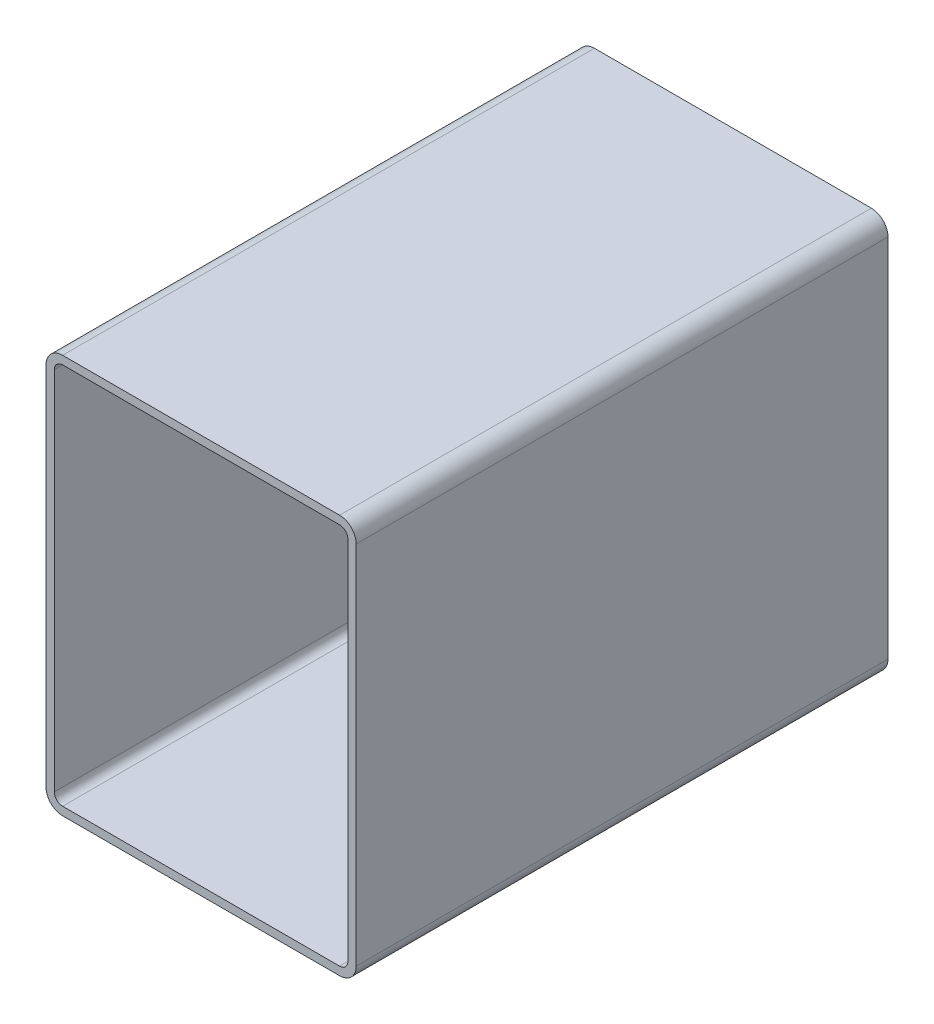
ISO-10303-21;
HEADER;
FILE_DESCRIPTION(('STEP AP214'),'2;1');
FILE_NAME('part.step','',(''),(''),'','','');
FILE_SCHEMA(('AUTOMOTIVE_DESIGN { 1 0 10303 214 1 1 1 1 }'));
ENDSEC;
DATA;
#1=APPLICATION_CONTEXT('core data for automotive mechanical design processes');
#2=APPLICATION_PROTOCOL_DEFINITION('international standard','automotive_design',2000,#1);
#3=PRODUCT_CONTEXT('',#1,'mechanical');
#4=PRODUCT('Part','Part','',(#3));
#5=PRODUCT_RELATED_PRODUCT_CATEGORY('part','',(#4));
#6=PRODUCT_DEFINITION_FORMATION('','',#4);
#7=PRODUCT_DEFINITION_CONTEXT('part definition',#1,'design');
#8=PRODUCT_DEFINITION('design','',#6,#7);
#9=PRODUCT_DEFINITION_SHAPE('','',#8);
#10=(LENGTH_UNIT() NAMED_UNIT(*) SI_UNIT(.MILLI.,.METRE.));
#11=(NAMED_UNIT(*) PLANE_ANGLE_UNIT() SI_UNIT($,.RADIAN.));
#12=(NAMED_UNIT(*) SI_UNIT($,.STERADIAN.) SOLID_ANGLE_UNIT());
#13=UNCERTAINTY_MEASURE_WITH_UNIT(LENGTH_MEASURE(1.E-05),#10,'distance_accuracy_value','');
#14=(GEOMETRIC_REPRESENTATION_CONTEXT(3) GLOBAL_UNCERTAINTY_ASSIGNED_CONTEXT((#13)) GLOBAL_UNIT_ASSIGNED_CONTEXT((#10,
#11,#12)) REPRESENTATION_CONTEXT('',''));
#15=CARTESIAN_POINT('',(0.,0.,0.));
#16=DIRECTION('',(0.,0.,1.));
#17=DIRECTION('',(1.,0.,0.));
#18=AXIS2_PLACEMENT_3D('',#15,#16,#17);
#19=CARTESIAN_POINT('',(170.479878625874,11.4682223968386,304.8));
#20=DIRECTION('',(0.,0.,1.));
#21=DIRECTION('',(1.,0.,0.));
#22=AXIS2_PLACEMENT_3D('',#19,#20,#21);
#23=PLANE('',#22);
#24=CARTESIAN_POINT('',(170.479878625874,11.4682223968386,304.8));
#25=DIRECTION('',(0.,0.,1.));
#26=DIRECTION('',(1.,0.,0.));
#27=AXIS2_PLACEMENT_3D('',#24,#25,#26);
#28=CIRCLE('',#27,9.52500000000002);
#29=CARTESIAN_POINT('',(170.479878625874,1.94322239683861,304.8));
#30=VERTEX_POINT('',#29);
#31=CARTESIAN_POINT('',(180.004878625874,11.4682223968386,304.8));
#32=VERTEX_POINT('',#31);
#33=EDGE_CURVE('E211',#30,#32,#28,.T.);
#34=ORIENTED_EDGE('',*,*,#33,.T.);
#35=DIRECTION('',(0.,1.,0.));
#36=VECTOR('',#35,1.);
#37=CARTESIAN_POINT('',(180.004878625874,221.018222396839,304.8));
#38=LINE('',#37,#36);
#39=CARTESIAN_POINT('',(180.004878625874,221.018222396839,304.8));
#40=VERTEX_POINT('',#39);
#41=EDGE_CURVE('E214',#32,#40,#38,.T.);
#42=ORIENTED_EDGE('',*,*,#41,.T.);
#43=CARTESIAN_POINT('',(170.479878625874,221.018222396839,304.8));
#44=DIRECTION('',(0.,0.,1.));
#45=DIRECTION('',(1.,0.,0.));
#46=AXIS2_PLACEMENT_3D('',#43,#44,#45);
#47=CIRCLE('',#46,9.52500000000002);
#48=CARTESIAN_POINT('',(170.479878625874,230.543222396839,304.8));
#49=VERTEX_POINT('',#48);
#50=EDGE_CURVE('E217',#40,#49,#47,.T.);
#51=ORIENTED_EDGE('',*,*,#50,.T.);
#52=DIRECTION('',(-1.,0.,0.));
#53=VECTOR('',#52,1.);
#54=CARTESIAN_POINT('',(11.7298786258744,230.543222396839,304.8));
#55=LINE('',#54,#53);
#56=CARTESIAN_POINT('',(11.7298786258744,230.543222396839,304.8));
#57=VERTEX_POINT('',#56);
#58=EDGE_CURVE('E219',#49,#57,#55,.T.);
#59=ORIENTED_EDGE('',*,*,#58,.T.);
#60=CARTESIAN_POINT('',(11.7298786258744,221.018222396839,304.8));
#61=DIRECTION('',(0.,0.,1.));
#62=DIRECTION('',(1.,0.,0.));
#63=AXIS2_PLACEMENT_3D('',#60,#61,#62);
#64=CIRCLE('',#63,9.52500000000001);
#65=CARTESIAN_POINT('',(2.20487862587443,221.018222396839,304.8));
#66=VERTEX_POINT('',#65);
#67=EDGE_CURVE('E221',#57,#66,#64,.T.);
#68=ORIENTED_EDGE('',*,*,#67,.T.);
#69=DIRECTION('',(0.,-1.,0.));
#70=VECTOR('',#69,1.);
#71=CARTESIAN_POINT('',(2.20487862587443,11.4682223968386,304.8));
#72=LINE('',#71,#70);
#73=CARTESIAN_POINT('',(2.20487862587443,11.4682223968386,304.8));
#74=VERTEX_POINT('',#73);
#75=EDGE_CURVE('E223',#66,#74,#72,.T.);
#76=ORIENTED_EDGE('',*,*,#75,.T.);
#77=CARTESIAN_POINT('',(11.7298786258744,11.4682223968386,304.8));
#78=DIRECTION('',(0.,0.,1.));
#79=DIRECTION('',(1.,0.,0.));
#80=AXIS2_PLACEMENT_3D('',#77,#78,#79);
#81=CIRCLE('',#80,9.525);
#82=CARTESIAN_POINT('',(11.7298786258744,1.94322239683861,304.8));
#83=VERTEX_POINT('',#82);
#84=EDGE_CURVE('E225',#74,#83,#81,.T.);
#85=ORIENTED_EDGE('',*,*,#84,.T.);
#86=DIRECTION('',(1.,0.,0.));
#87=VECTOR('',#86,1.);
#88=CARTESIAN_POINT('',(170.479878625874,1.94322239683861,304.8));
#89=LINE('',#88,#87);
#90=EDGE_CURVE('E227',#83,#30,#89,.T.);
#91=ORIENTED_EDGE('',*,*,#90,.T.);
#92=EDGE_LOOP('',(#34,#42,#51,#59,#68,#76,#85,#91));
#93=FACE_BOUND('',#92,.T.);
#94=DIRECTION('',(0.,-1.,0.));
#95=VECTOR('',#94,1.);
#96=CARTESIAN_POINT('',(6.96737862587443,11.4682223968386,304.8));
#97=LINE('',#96,#95);
#98=CARTESIAN_POINT('',(6.96737862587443,221.018222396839,304.8));
#99=VERTEX_POINT('',#98);
#100=CARTESIAN_POINT('',(6.96737862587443,11.4682223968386,304.8));
#101=VERTEX_POINT('',#100);
#102=EDGE_CURVE('E154',#99,#101,#97,.T.);
#103=ORIENTED_EDGE('',*,*,#102,.F.);
#104=CARTESIAN_POINT('',(11.7298786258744,221.018222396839,304.8));
#105=DIRECTION('',(0.,0.,1.));
#106=DIRECTION('',(1.,0.,0.));
#107=AXIS2_PLACEMENT_3D('',#104,#105,#106);
#108=CIRCLE('',#107,4.76250000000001);
#109=CARTESIAN_POINT('',(11.7298786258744,225.780722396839,304.8));
#110=VERTEX_POINT('',#109);
#111=EDGE_CURVE('E146',#110,#99,#108,.T.);
#112=ORIENTED_EDGE('',*,*,#111,.F.);
#113=DIRECTION('',(-1.,0.,0.));
#114=VECTOR('',#113,1.);
#115=CARTESIAN_POINT('',(11.7298786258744,225.780722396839,304.8));
#116=LINE('',#115,#114);
#117=CARTESIAN_POINT('',(170.479878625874,225.780722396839,304.8));
#118=VERTEX_POINT('',#117);
#119=EDGE_CURVE('E179',#118,#110,#116,.T.);
#120=ORIENTED_EDGE('',*,*,#119,.F.);
#121=CARTESIAN_POINT('',(170.479878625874,221.018222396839,304.8));
#122=DIRECTION('',(0.,0.,1.));
#123=DIRECTION('',(1.,0.,0.));
#124=AXIS2_PLACEMENT_3D('',#121,#122,#123);
#125=CIRCLE('',#124,4.7625);
#126=CARTESIAN_POINT('',(175.242378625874,221.018222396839,304.8));
#127=VERTEX_POINT('',#126);
#128=EDGE_CURVE('E177',#127,#118,#125,.T.);
#129=ORIENTED_EDGE('',*,*,#128,.F.);
#130=DIRECTION('',(0.,1.,0.));
#131=VECTOR('',#130,1.);
#132=CARTESIAN_POINT('',(175.242378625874,221.018222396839,304.8));
#133=LINE('',#132,#131);
#134=CARTESIAN_POINT('',(175.242378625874,11.4682223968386,304.8));
#135=VERTEX_POINT('',#134);
#136=EDGE_CURVE('E175',#135,#127,#133,.T.);
#137=ORIENTED_EDGE('',*,*,#136,.F.);
#138=CARTESIAN_POINT('',(170.479878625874,11.4682223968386,304.8));
#139=DIRECTION('',(0.,0.,1.));
#140=DIRECTION('',(1.,0.,0.));
#141=AXIS2_PLACEMENT_3D('',#138,#139,#140);
#142=CIRCLE('',#141,4.7625);
#143=CARTESIAN_POINT('',(170.479878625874,6.70572239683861,304.8));
#144=VERTEX_POINT('',#143);
#145=EDGE_CURVE('E173',#144,#135,#142,.T.);
#146=ORIENTED_EDGE('',*,*,#145,.F.);
#147=DIRECTION('',(1.,0.,0.));
#148=VECTOR('',#147,1.);
#149=CARTESIAN_POINT('',(170.479878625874,6.70572239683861,304.8));
#150=LINE('',#149,#148);
#151=CARTESIAN_POINT('',(11.7298786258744,6.70572239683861,304.8));
#152=VERTEX_POINT('',#151);
#153=EDGE_CURVE('E169',#152,#144,#150,.T.);
#154=ORIENTED_EDGE('',*,*,#153,.F.);
#155=CARTESIAN_POINT('',(11.7298786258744,11.4682223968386,304.8));
#156=DIRECTION('',(0.,0.,1.));
#157=DIRECTION('',(1.,0.,0.));
#158=AXIS2_PLACEMENT_3D('',#155,#156,#157);
#159=CIRCLE('',#158,4.7625);
#160=EDGE_CURVE('E167',#101,#152,#159,.T.);
#161=ORIENTED_EDGE('',*,*,#160,.F.);
#162=EDGE_LOOP('',(#103,#112,#120,#129,#137,#146,#154,#161));
#163=FACE_BOUND('',#162,.T.);
#164=ADVANCED_FACE('F33',(#93,#163),#23,.T.);
#165=CARTESIAN_POINT('',(170.479878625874,11.4682223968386,0.));
#166=DIRECTION('',(0.,0.,1.));
#167=DIRECTION('',(1.,0.,0.));
#168=AXIS2_PLACEMENT_3D('',#165,#166,#167);
#169=PLANE('',#168);
#170=CARTESIAN_POINT('',(170.479878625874,11.4682223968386,0.));
#171=DIRECTION('',(0.,0.,1.));
#172=DIRECTION('',(1.,0.,0.));
#173=AXIS2_PLACEMENT_3D('',#170,#171,#172);
#174=CIRCLE('',#173,9.52500000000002);
#175=CARTESIAN_POINT('',(170.479878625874,1.94322239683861,0.));
#176=VERTEX_POINT('',#175);
#177=CARTESIAN_POINT('',(180.004878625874,11.4682223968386,0.));
#178=VERTEX_POINT('',#177);
#179=EDGE_CURVE('E162',#176,#178,#174,.T.);
#180=ORIENTED_EDGE('',*,*,#179,.F.);
#181=DIRECTION('',(1.,0.,0.));
#182=VECTOR('',#181,1.);
#183=CARTESIAN_POINT('',(170.479878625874,1.94322239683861,0.));
#184=LINE('',#183,#182);
#185=CARTESIAN_POINT('',(11.7298786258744,1.94322239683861,0.));
#186=VERTEX_POINT('',#185);
#187=EDGE_CURVE('E215',#186,#176,#184,.T.);
#188=ORIENTED_EDGE('',*,*,#187,.F.);
#189=CARTESIAN_POINT('',(11.7298786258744,11.4682223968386,0.));
#190=DIRECTION('',(0.,0.,1.));
#191=DIRECTION('',(1.,0.,0.));
#192=AXIS2_PLACEMENT_3D('',#189,#190,#191);
#193=CIRCLE('',#192,9.525);
#194=CARTESIAN_POINT('',(2.20487862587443,11.4682223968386,0.));
#195=VERTEX_POINT('',#194);
#196=EDGE_CURVE('E242',#195,#186,#193,.T.);
#197=ORIENTED_EDGE('',*,*,#196,.F.);
#198=DIRECTION('',(0.,-1.,0.));
#199=VECTOR('',#198,1.);
#200=CARTESIAN_POINT('',(2.20487862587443,11.4682223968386,0.));
#201=LINE('',#200,#199);
#202=CARTESIAN_POINT('',(2.20487862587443,221.018222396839,0.));
#203=VERTEX_POINT('',#202);
#204=EDGE_CURVE('E240',#203,#195,#201,.T.);
#205=ORIENTED_EDGE('',*,*,#204,.F.);
#206=CARTESIAN_POINT('',(11.7298786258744,221.018222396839,0.));
#207=DIRECTION('',(0.,0.,1.));
#208=DIRECTION('',(1.,0.,0.));
#209=AXIS2_PLACEMENT_3D('',#206,#207,#208);
#210=CIRCLE('',#209,9.52500000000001);
#211=CARTESIAN_POINT('',(11.7298786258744,230.543222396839,0.));
#212=VERTEX_POINT('',#211);
#213=EDGE_CURVE('E238',#212,#203,#210,.T.);
#214=ORIENTED_EDGE('',*,*,#213,.F.);
#215=DIRECTION('',(-1.,0.,0.));
#216=VECTOR('',#215,1.);
#217=CARTESIAN_POINT('',(11.7298786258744,230.543222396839,0.));
#218=LINE('',#217,#216);
#219=CARTESIAN_POINT('',(170.479878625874,230.543222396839,0.));
#220=VERTEX_POINT('',#219);
#221=EDGE_CURVE('E236',#220,#212,#218,.T.);
#222=ORIENTED_EDGE('',*,*,#221,.F.);
#223=CARTESIAN_POINT('',(170.479878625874,221.018222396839,0.));
#224=DIRECTION('',(0.,0.,1.));
#225=DIRECTION('',(1.,0.,0.));
#226=AXIS2_PLACEMENT_3D('',#223,#224,#225);
#227=CIRCLE('',#226,9.52500000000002);
#228=CARTESIAN_POINT('',(180.004878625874,221.018222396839,0.));
#229=VERTEX_POINT('',#228);
#230=EDGE_CURVE('E234',#229,#220,#227,.T.);
#231=ORIENTED_EDGE('',*,*,#230,.F.);
#232=DIRECTION('',(0.,1.,0.));
#233=VECTOR('',#232,1.);
#234=CARTESIAN_POINT('',(180.004878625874,221.018222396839,0.));
#235=LINE('',#234,#233);
#236=EDGE_CURVE('E232',#178,#229,#235,.T.);
#237=ORIENTED_EDGE('',*,*,#236,.F.);
#238=EDGE_LOOP('',(#180,#188,#197,#205,#214,#222,#231,#237));
#239=FACE_BOUND('',#238,.T.);
#240=CARTESIAN_POINT('',(11.7298786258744,221.018222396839,0.));
#241=DIRECTION('',(0.,0.,1.));
#242=DIRECTION('',(1.,0.,0.));
#243=AXIS2_PLACEMENT_3D('',#240,#241,#242);
#244=CIRCLE('',#243,4.76250000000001);
#245=CARTESIAN_POINT('',(11.7298786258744,225.780722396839,0.));
#246=VERTEX_POINT('',#245);
#247=CARTESIAN_POINT('',(6.96737862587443,221.018222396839,0.));
#248=VERTEX_POINT('',#247);
#249=EDGE_CURVE('E56',#246,#248,#244,.T.);
#250=ORIENTED_EDGE('',*,*,#249,.T.);
#251=DIRECTION('',(0.,-1.,0.));
#252=VECTOR('',#251,1.);
#253=CARTESIAN_POINT('',(6.96737862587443,11.4682223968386,0.));
#254=LINE('',#253,#252);
#255=CARTESIAN_POINT('',(6.96737862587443,11.4682223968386,0.));
#256=VERTEX_POINT('',#255);
#257=EDGE_CURVE('E161',#248,#256,#254,.T.);
#258=ORIENTED_EDGE('',*,*,#257,.T.);
#259=CARTESIAN_POINT('',(11.7298786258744,11.4682223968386,0.));
#260=DIRECTION('',(0.,0.,1.));
#261=DIRECTION('',(1.,0.,0.));
#262=AXIS2_PLACEMENT_3D('',#259,#260,#261);
#263=CIRCLE('',#262,4.7625);
#264=CARTESIAN_POINT('',(11.7298786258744,6.70572239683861,0.));
#265=VERTEX_POINT('',#264);
#266=EDGE_CURVE('E183',#256,#265,#263,.T.);
#267=ORIENTED_EDGE('',*,*,#266,.T.);
#268=DIRECTION('',(1.,0.,0.));
#269=VECTOR('',#268,1.);
#270=CARTESIAN_POINT('',(170.479878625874,6.70572239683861,0.));
#271=LINE('',#270,#269);
#272=CARTESIAN_POINT('',(170.479878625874,6.70572239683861,0.));
#273=VERTEX_POINT('',#272);
#274=EDGE_CURVE('E186',#265,#273,#271,.T.);
#275=ORIENTED_EDGE('',*,*,#274,.T.);
#276=CARTESIAN_POINT('',(170.479878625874,11.4682223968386,0.));
#277=DIRECTION('',(0.,0.,1.));
#278=DIRECTION('',(1.,0.,0.));
#279=AXIS2_PLACEMENT_3D('',#276,#277,#278);
#280=CIRCLE('',#279,4.7625);
#281=CARTESIAN_POINT('',(175.242378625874,11.4682223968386,0.));
#282=VERTEX_POINT('',#281);
#283=EDGE_CURVE('E189',#273,#282,#280,.T.);
#284=ORIENTED_EDGE('',*,*,#283,.T.);
#285=DIRECTION('',(0.,1.,0.));
#286=VECTOR('',#285,1.);
#287=CARTESIAN_POINT('',(175.242378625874,221.018222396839,0.));
#288=LINE('',#287,#286);
#289=CARTESIAN_POINT('',(175.242378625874,221.018222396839,0.));
#290=VERTEX_POINT('',#289);
#291=EDGE_CURVE('E192',#282,#290,#288,.T.);
#292=ORIENTED_EDGE('',*,*,#291,.T.);
#293=CARTESIAN_POINT('',(170.479878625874,221.018222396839,0.));
#294=DIRECTION('',(0.,0.,1.));
#295=DIRECTION('',(1.,0.,0.));
#296=AXIS2_PLACEMENT_3D('',#293,#294,#295);
#297=CIRCLE('',#296,4.7625);
#298=CARTESIAN_POINT('',(170.479878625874,225.780722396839,0.));
#299=VERTEX_POINT('',#298);
#300=EDGE_CURVE('E195',#290,#299,#297,.T.);
#301=ORIENTED_EDGE('',*,*,#300,.T.);
#302=DIRECTION('',(-1.,0.,0.));
#303=VECTOR('',#302,1.);
#304=CARTESIAN_POINT('',(11.7298786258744,225.780722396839,0.));
#305=LINE('',#304,#303);
#306=EDGE_CURVE('E155',#299,#246,#305,.T.);
#307=ORIENTED_EDGE('',*,*,#306,.T.);
#308=EDGE_LOOP('',(#250,#258,#267,#275,#284,#292,#301,#307));
#309=FACE_BOUND('',#308,.T.);
#310=ADVANCED_FACE('F272',(#239,#309),#169,.F.);
#311=CARTESIAN_POINT('',(170.479878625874,11.4682223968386,304.8));
#312=DIRECTION('',(0.,0.,-1.));
#313=DIRECTION('',(-1.,0.,0.));
#314=AXIS2_PLACEMENT_3D('',#311,#312,#313);
#315=CYLINDRICAL_SURFACE('',#314,9.52500000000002);
#316=ORIENTED_EDGE('',*,*,#179,.T.);
#317=DIRECTION('',(0.,0.,-1.));
#318=VECTOR('',#317,1.);
#319=CARTESIAN_POINT('',(180.004878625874,11.4682223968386,304.8));
#320=LINE('',#319,#318);
#321=EDGE_CURVE('E11',#32,#178,#320,.T.);
#322=ORIENTED_EDGE('',*,*,#321,.F.);
#323=ORIENTED_EDGE('',*,*,#33,.F.);
#324=DIRECTION('',(0.,0.,-1.));
#325=VECTOR('',#324,1.);
#326=CARTESIAN_POINT('',(170.479878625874,1.94322239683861,304.8));
#327=LINE('',#326,#325);
#328=EDGE_CURVE('E229',#30,#176,#327,.T.);
#329=ORIENTED_EDGE('',*,*,#328,.T.);
#330=EDGE_LOOP('',(#316,#322,#323,#329));
#331=FACE_BOUND('',#330,.T.);
#332=ADVANCED_FACE('F35',(#331),#315,.T.);
#333=CARTESIAN_POINT('',(180.004878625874,221.018222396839,304.8));
#334=DIRECTION('',(-1.,0.,0.));
#335=DIRECTION('',(0.,0.,1.));
#336=AXIS2_PLACEMENT_3D('',#333,#334,#335);
#337=PLANE('',#336);
#338=ORIENTED_EDGE('',*,*,#236,.T.);
#339=DIRECTION('',(0.,0.,-1.));
#340=VECTOR('',#339,1.);
#341=CARTESIAN_POINT('',(180.004878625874,221.018222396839,304.8));
#342=LINE('',#341,#340);
#343=EDGE_CURVE('E41',#40,#229,#342,.T.);
#344=ORIENTED_EDGE('',*,*,#343,.F.);
#345=ORIENTED_EDGE('',*,*,#41,.F.);
#346=ORIENTED_EDGE('',*,*,#321,.T.);
#347=EDGE_LOOP('',(#338,#344,#345,#346));
#348=FACE_BOUND('',#347,.T.);
#349=ADVANCED_FACE('F289',(#348),#337,.F.);
#350=CARTESIAN_POINT('',(170.479878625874,221.018222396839,304.8));
#351=DIRECTION('',(0.,0.,-1.));
#352=DIRECTION('',(-1.,0.,0.));
#353=AXIS2_PLACEMENT_3D('',#350,#351,#352);
#354=CYLINDRICAL_SURFACE('',#353,9.52500000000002);
#355=ORIENTED_EDGE('',*,*,#230,.T.);
#356=DIRECTION('',(0.,0.,-1.));
#357=VECTOR('',#356,1.);
#358=CARTESIAN_POINT('',(170.479878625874,230.543222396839,304.8));
#359=LINE('',#358,#357);
#360=EDGE_CURVE('E259',#49,#220,#359,.T.);
#361=ORIENTED_EDGE('',*,*,#360,.F.);
#362=ORIENTED_EDGE('',*,*,#50,.F.);
#363=ORIENTED_EDGE('',*,*,#343,.T.);
#364=EDGE_LOOP('',(#355,#361,#362,#363));
#365=FACE_BOUND('',#364,.T.);
#366=ADVANCED_FACE('F266',(#365),#354,.T.);
#367=CARTESIAN_POINT('',(11.7298786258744,230.543222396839,304.8));
#368=DIRECTION('',(0.,-1.,0.));
#369=DIRECTION('',(0.,0.,-1.));
#370=AXIS2_PLACEMENT_3D('',#367,#368,#369);
#371=PLANE('',#370);
#372=ORIENTED_EDGE('',*,*,#221,.T.);
#373=DIRECTION('',(0.,0.,-1.));
#374=VECTOR('',#373,1.);
#375=CARTESIAN_POINT('',(11.7298786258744,230.543222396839,304.8));
#376=LINE('',#375,#374);
#377=EDGE_CURVE('E256',#57,#212,#376,.T.);
#378=ORIENTED_EDGE('',*,*,#377,.F.);
#379=ORIENTED_EDGE('',*,*,#58,.F.);
#380=ORIENTED_EDGE('',*,*,#360,.T.);
#381=EDGE_LOOP('',(#372,#378,#379,#380));
#382=FACE_BOUND('',#381,.T.);
#383=ADVANCED_FACE('F278',(#382),#371,.F.);
#384=CARTESIAN_POINT('',(11.7298786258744,221.018222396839,304.8));
#385=DIRECTION('',(0.,0.,-1.));
#386=DIRECTION('',(-1.,0.,0.));
#387=AXIS2_PLACEMENT_3D('',#384,#385,#386);
#388=CYLINDRICAL_SURFACE('',#387,9.52500000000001);
#389=ORIENTED_EDGE('',*,*,#213,.T.);
#390=DIRECTION('',(0.,0.,-1.));
#391=VECTOR('',#390,1.);
#392=CARTESIAN_POINT('',(2.20487862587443,221.018222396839,304.8));
#393=LINE('',#392,#391);
#394=EDGE_CURVE('E253',#66,#203,#393,.T.);
#395=ORIENTED_EDGE('',*,*,#394,.F.);
#396=ORIENTED_EDGE('',*,*,#67,.F.);
#397=ORIENTED_EDGE('',*,*,#377,.T.);
#398=EDGE_LOOP('',(#389,#395,#396,#397));
#399=FACE_BOUND('',#398,.T.);
#400=ADVANCED_FACE('F282',(#399),#388,.T.);
#401=CARTESIAN_POINT('',(2.20487862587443,11.4682223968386,304.8));
#402=DIRECTION('',(1.,0.,0.));
#403=DIRECTION('',(0.,0.,-1.));
#404=AXIS2_PLACEMENT_3D('',#401,#402,#403);
#405=PLANE('',#404);
#406=ORIENTED_EDGE('',*,*,#204,.T.);
#407=DIRECTION('',(0.,0.,-1.));
#408=VECTOR('',#407,1.);
#409=CARTESIAN_POINT('',(2.20487862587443,11.4682223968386,304.8));
#410=LINE('',#409,#408);
#411=EDGE_CURVE('E250',#74,#195,#410,.T.);
#412=ORIENTED_EDGE('',*,*,#411,.F.);
#413=ORIENTED_EDGE('',*,*,#75,.F.);
#414=ORIENTED_EDGE('',*,*,#394,.T.);
#415=EDGE_LOOP('',(#406,#412,#413,#414));
#416=FACE_BOUND('',#415,.T.);
#417=ADVANCED_FACE('F302',(#416),#405,.F.);
#418=CARTESIAN_POINT('',(11.7298786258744,11.4682223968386,304.8));
#419=DIRECTION('',(0.,0.,-1.));
#420=DIRECTION('',(-1.,0.,0.));
#421=AXIS2_PLACEMENT_3D('',#418,#419,#420);
#422=CYLINDRICAL_SURFACE('',#421,9.525);
#423=ORIENTED_EDGE('',*,*,#196,.T.);
#424=DIRECTION('',(0.,0.,-1.));
#425=VECTOR('',#424,1.);
#426=CARTESIAN_POINT('',(11.7298786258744,1.94322239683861,304.8));
#427=LINE('',#426,#425);
#428=EDGE_CURVE('E247',#83,#186,#427,.T.);
#429=ORIENTED_EDGE('',*,*,#428,.F.);
#430=ORIENTED_EDGE('',*,*,#84,.F.);
#431=ORIENTED_EDGE('',*,*,#411,.T.);
#432=EDGE_LOOP('',(#423,#429,#430,#431));
#433=FACE_BOUND('',#432,.T.);
#434=ADVANCED_FACE('F300',(#433),#422,.T.);
#435=CARTESIAN_POINT('',(170.479878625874,1.94322239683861,304.8));
#436=DIRECTION('',(0.,1.,0.));
#437=DIRECTION('',(0.,0.,1.));
#438=AXIS2_PLACEMENT_3D('',#435,#436,#437);
#439=PLANE('',#438);
#440=ORIENTED_EDGE('',*,*,#187,.T.);
#441=ORIENTED_EDGE('',*,*,#328,.F.);
#442=ORIENTED_EDGE('',*,*,#90,.F.);
#443=ORIENTED_EDGE('',*,*,#428,.T.);
#444=EDGE_LOOP('',(#440,#441,#442,#443));
#445=FACE_BOUND('',#444,.T.);
#446=ADVANCED_FACE('F295',(#445),#439,.F.);
#447=CARTESIAN_POINT('',(11.7298786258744,221.018222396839,304.8));
#448=DIRECTION('',(0.,0.,-1.));
#449=DIRECTION('',(-1.,0.,0.));
#450=AXIS2_PLACEMENT_3D('',#447,#448,#449);
#451=CYLINDRICAL_SURFACE('',#450,4.76250000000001);
#452=ORIENTED_EDGE('',*,*,#249,.F.);
#453=DIRECTION('',(0.,0.,-1.));
#454=VECTOR('',#453,1.);
#455=CARTESIAN_POINT('',(11.7298786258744,225.780722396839,304.8));
#456=LINE('',#455,#454);
#457=EDGE_CURVE('E150',#110,#246,#456,.T.);
#458=ORIENTED_EDGE('',*,*,#457,.F.);
#459=ORIENTED_EDGE('',*,*,#111,.T.);
#460=DIRECTION('',(0.,0.,-1.));
#461=VECTOR('',#460,1.);
#462=CARTESIAN_POINT('',(6.96737862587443,221.018222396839,304.8));
#463=LINE('',#462,#461);
#464=EDGE_CURVE('E149',#99,#248,#463,.T.);
#465=ORIENTED_EDGE('',*,*,#464,.T.);
#466=EDGE_LOOP('',(#452,#458,#459,#465));
#467=FACE_BOUND('',#466,.T.);
#468=ADVANCED_FACE('F148',(#467),#451,.F.);
#469=CARTESIAN_POINT('',(6.96737862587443,11.4682223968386,304.8));
#470=DIRECTION('',(1.,0.,0.));
#471=DIRECTION('',(0.,0.,-1.));
#472=AXIS2_PLACEMENT_3D('',#469,#470,#471);
#473=PLANE('',#472);
#474=ORIENTED_EDGE('',*,*,#257,.F.);
#475=ORIENTED_EDGE('',*,*,#464,.F.);
#476=ORIENTED_EDGE('',*,*,#102,.T.);
#477=DIRECTION('',(0.,0.,-1.));
#478=VECTOR('',#477,1.);
#479=CARTESIAN_POINT('',(6.96737862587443,11.4682223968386,304.8));
#480=LINE('',#479,#478);
#481=EDGE_CURVE('E163',#101,#256,#480,.T.);
#482=ORIENTED_EDGE('',*,*,#481,.T.);
#483=EDGE_LOOP('',(#474,#475,#476,#482));
#484=FACE_BOUND('',#483,.T.);
#485=ADVANCED_FACE('F158',(#484),#473,.T.);
#486=CARTESIAN_POINT('',(11.7298786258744,11.4682223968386,304.8));
#487=DIRECTION('',(0.,0.,-1.));
#488=DIRECTION('',(-1.,0.,0.));
#489=AXIS2_PLACEMENT_3D('',#486,#487,#488);
#490=CYLINDRICAL_SURFACE('',#489,4.7625);
#491=ORIENTED_EDGE('',*,*,#266,.F.);
#492=ORIENTED_EDGE('',*,*,#481,.F.);
#493=ORIENTED_EDGE('',*,*,#160,.T.);
#494=DIRECTION('',(0.,0.,-1.));
#495=VECTOR('',#494,1.);
#496=CARTESIAN_POINT('',(11.7298786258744,6.70572239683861,304.8));
#497=LINE('',#496,#495);
#498=EDGE_CURVE('E208',#152,#265,#497,.T.);
#499=ORIENTED_EDGE('',*,*,#498,.T.);
#500=EDGE_LOOP('',(#491,#492,#493,#499));
#501=FACE_BOUND('',#500,.T.);
#502=ADVANCED_FACE('F327',(#501),#490,.F.);
#503=CARTESIAN_POINT('',(170.479878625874,6.70572239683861,304.8));
#504=DIRECTION('',(0.,1.,0.));
#505=DIRECTION('',(0.,0.,1.));
#506=AXIS2_PLACEMENT_3D('',#503,#504,#505);
#507=PLANE('',#506);
#508=ORIENTED_EDGE('',*,*,#274,.F.);
#509=ORIENTED_EDGE('',*,*,#498,.F.);
#510=ORIENTED_EDGE('',*,*,#153,.T.);
#511=DIRECTION('',(0.,0.,-1.));
#512=VECTOR('',#511,1.);
#513=CARTESIAN_POINT('',(170.479878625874,6.70572239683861,304.8));
#514=LINE('',#513,#512);
#515=EDGE_CURVE('E206',#144,#273,#514,.T.);
#516=ORIENTED_EDGE('',*,*,#515,.T.);
#517=EDGE_LOOP('',(#508,#509,#510,#516));
#518=FACE_BOUND('',#517,.T.);
#519=ADVANCED_FACE('F331',(#518),#507,.T.);
#520=CARTESIAN_POINT('',(170.479878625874,11.4682223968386,304.8));
#521=DIRECTION('',(0.,0.,-1.));
#522=DIRECTION('',(-1.,0.,0.));
#523=AXIS2_PLACEMENT_3D('',#520,#521,#522);
#524=CYLINDRICAL_SURFACE('',#523,4.7625);
#525=ORIENTED_EDGE('',*,*,#283,.F.);
#526=ORIENTED_EDGE('',*,*,#515,.F.);
#527=ORIENTED_EDGE('',*,*,#145,.T.);
#528=DIRECTION('',(0.,0.,-1.));
#529=VECTOR('',#528,1.);
#530=CARTESIAN_POINT('',(175.242378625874,11.4682223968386,304.8));
#531=LINE('',#530,#529);
#532=EDGE_CURVE('E204',#135,#282,#531,.T.);
#533=ORIENTED_EDGE('',*,*,#532,.T.);
#534=EDGE_LOOP('',(#525,#526,#527,#533));
#535=FACE_BOUND('',#534,.T.);
#536=ADVANCED_FACE('F337',(#535),#524,.F.);
#537=CARTESIAN_POINT('',(175.242378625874,221.018222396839,304.8));
#538=DIRECTION('',(-1.,0.,0.));
#539=DIRECTION('',(0.,0.,1.));
#540=AXIS2_PLACEMENT_3D('',#537,#538,#539);
#541=PLANE('',#540);
#542=ORIENTED_EDGE('',*,*,#291,.F.);
#543=ORIENTED_EDGE('',*,*,#532,.F.);
#544=ORIENTED_EDGE('',*,*,#136,.T.);
#545=DIRECTION('',(0.,0.,-1.));
#546=VECTOR('',#545,1.);
#547=CARTESIAN_POINT('',(175.242378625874,221.018222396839,304.8));
#548=LINE('',#547,#546);
#549=EDGE_CURVE('E202',#127,#290,#548,.T.);
#550=ORIENTED_EDGE('',*,*,#549,.T.);
#551=EDGE_LOOP('',(#542,#543,#544,#550));
#552=FACE_BOUND('',#551,.T.);
#553=ADVANCED_FACE('F341',(#552),#541,.T.);
#554=CARTESIAN_POINT('',(170.479878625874,221.018222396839,304.8));
#555=DIRECTION('',(0.,0.,-1.));
#556=DIRECTION('',(-1.,0.,0.));
#557=AXIS2_PLACEMENT_3D('',#554,#555,#556);
#558=CYLINDRICAL_SURFACE('',#557,4.7625);
#559=ORIENTED_EDGE('',*,*,#300,.F.);
#560=ORIENTED_EDGE('',*,*,#549,.F.);
#561=ORIENTED_EDGE('',*,*,#128,.T.);
#562=DIRECTION('',(0.,0.,-1.));
#563=VECTOR('',#562,1.);
#564=CARTESIAN_POINT('',(170.479878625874,225.780722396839,304.8));
#565=LINE('',#564,#563);
#566=EDGE_CURVE('E48',#118,#299,#565,.T.);
#567=ORIENTED_EDGE('',*,*,#566,.T.);
#568=EDGE_LOOP('',(#559,#560,#561,#567));
#569=FACE_BOUND('',#568,.T.);
#570=ADVANCED_FACE('F345',(#569),#558,.F.);
#571=CARTESIAN_POINT('',(11.7298786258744,225.780722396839,304.8));
#572=DIRECTION('',(0.,-1.,0.));
#573=DIRECTION('',(0.,0.,-1.));
#574=AXIS2_PLACEMENT_3D('',#571,#572,#573);
#575=PLANE('',#574);
#576=ORIENTED_EDGE('',*,*,#306,.F.);
#577=ORIENTED_EDGE('',*,*,#566,.F.);
#578=ORIENTED_EDGE('',*,*,#119,.T.);
#579=ORIENTED_EDGE('',*,*,#457,.T.);
#580=EDGE_LOOP('',(#576,#577,#578,#579));
#581=FACE_BOUND('',#580,.T.);
#582=ADVANCED_FACE('F349',(#581),#575,.T.);
#583=CLOSED_SHELL('',(#164,#310,#332,#349,#366,#383,#400,#417,#434,#446,#468,#485,#502,#519,
#536,#553,#570,#582));
#584=MANIFOLD_SOLID_BREP('B2',#583);
#585=ADVANCED_BREP_SHAPE_REPRESENTATION('',(#18,#584),#14);
#586=SHAPE_DEFINITION_REPRESENTATION(#9,#585);
ENDSEC;
END-ISO-10303-21;
